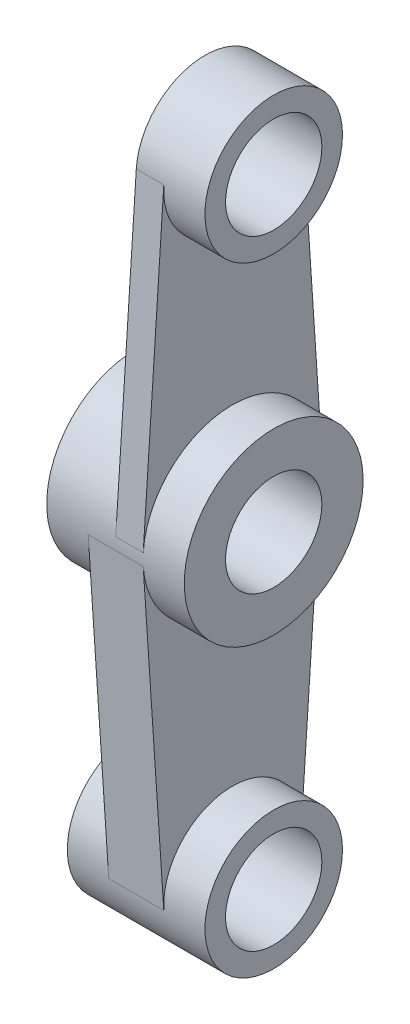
from build123d import *

# Parameters (mm, degrees)
BOSS_EXTRUDE1_DEPTH = 10
BOSS_EXTRUDE2_DEPTH = 10
SKETCH1_4_R         = 25
SKETCH1_4_R_2       = 17.5
BOSS_EXTRUDE3_DEPTH = 25
SKETCH1_5_R         = 32.5
SKETCH1_5_R_2       = 17.5
SKETCH1_5_R_3       = 25
BOSS_EXTRUDE4_DEPTH = 25


with BuildPart() as part:
    # Sketch1 → Boss-Extrude1 (new, symmetric)
    with BuildSketch(Plane(origin=(0, 0, 0), x_dir=(0, 0, -1), z_dir=(1, 0, 0))):
        with BuildLine():
            Line((0, -32.5), (0, -87.5))
            ThreePointArc((0, -87.5), (17.67766953, -94.82233047), (25, -112.5))
            ThreePointArc((25, -112.5), (24.986091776, -113.333797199), (24.944382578, -114.166666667))
            Line((24.944382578, -114.166666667), (32.427697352, -2.166666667))
            ThreePointArc((32.427697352, -2.166666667), (22.20172666, -23.734644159), (0, -32.5))
        make_face()
        with BuildLine():
            ThreePointArc((-24.944382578, -114.166666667), (-18.257418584, -95.421748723), (0, -87.5))
            Line((0, -87.5), (0, -32.5))
            ThreePointArc((0, -32.5), (-22.20172666, -23.734644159), (-32.427697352, -2.166666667))
            Line((-32.427697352, -2.166666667), (-24.944382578, -114.166666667))
        make_face()
    extrude(amount=BOSS_EXTRUDE1_DEPTH, both=True)



with BuildPart() as body_2:
    # Sketch1_3 → Boss-Extrude2 (new body)
    with BuildSketch(Plane(origin=(0, 0, 0), x_dir=(0, 0, -1), z_dir=(1, 0, 0))):
        with BuildLine():
            Line((-24.944382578, 114.166666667), (-32.427697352, 2.166666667))
            ThreePointArc((-32.427697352, 2.166666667), (-22.20172666, 23.734644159), (0, 32.5))
            Line((0, 32.5), (0, 87.5))
            ThreePointArc((0, 87.5), (-18.257418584, 95.421748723), (-24.944382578, 114.166666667))
        make_face()
        with BuildLine():
            Line((0, 87.5), (0, 32.5))
            ThreePointArc((0, 32.5), (22.20172666, 23.734644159), (32.427697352, 2.166666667))
            Line((32.427697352, 2.166666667), (24.944382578, 114.166666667))
            ThreePointArc((24.944382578, 114.166666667), (24.986091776, 113.333797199), (25, 112.5))
            ThreePointArc((25, 112.5), (17.67766953, 94.82233047), (0, 87.5))
        make_face()
    extrude(amount=BOSS_EXTRUDE2_DEPTH)

    # Sketch1_4 → Boss-Extrude3 (add)
    with BuildSketch(Plane(origin=(0, 0, 0), x_dir=(0, 0, -1), z_dir=(1, 0, 0))):
        with Locations(Location((0, 112.5, 0), (0, 0, 176.177446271))):
            Circle(SKETCH1_4_R)
        with Locations((0, 112.5)):
            Circle(SKETCH1_4_R_2, mode=Mode.SUBTRACT)
    extrude(amount=BOSS_EXTRUDE3_DEPTH)


with BuildPart() as part_1:
    add(part.part)

    add(body_2.part)  # Boss-Extrude4 merges body 2
    # Sketch1_5 → Boss-Extrude4 (add, symmetric)
    # profile 1 of 2: a face of its own
    with BuildSketch(Plane(origin=(0, 0, 0), x_dir=(0, 0, -1), z_dir=(1, 0, 0))):
        Circle(SKETCH1_5_R)
        Circle(SKETCH1_5_R_2, mode=Mode.SUBTRACT)
    # profile 2 of 2: a face of its own
    with BuildSketch(Plane(origin=(0, 0, 0), x_dir=(0, 0, -1), z_dir=(1, 0, 0))):
        with Locations((0, -112.5)):
            Circle(SKETCH1_5_R_3)
        with Locations((0, -112.5)):
            Circle(SKETCH1_5_R_2, mode=Mode.SUBTRACT)
    extrude(amount=BOSS_EXTRUDE4_DEPTH, both=True)


solid = part_1.part
